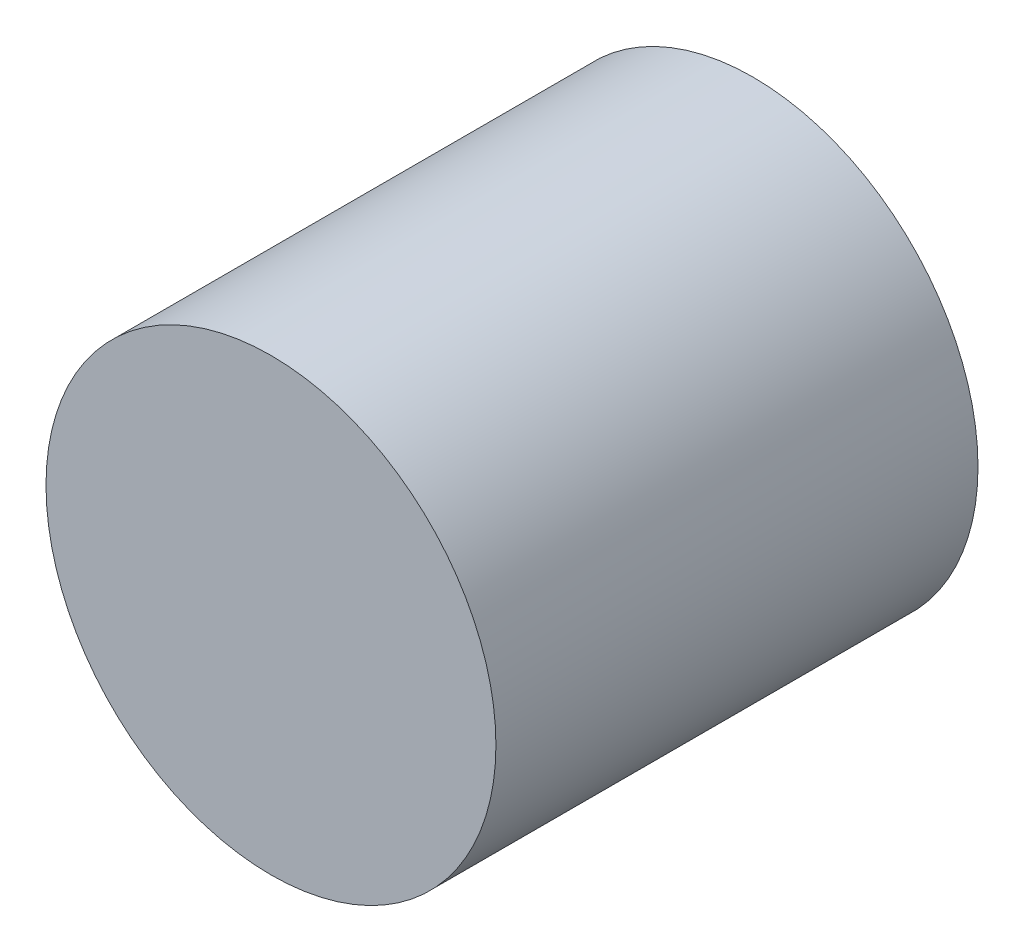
ISO-10303-21;
HEADER;
FILE_DESCRIPTION(('STEP AP214'),'2;1');
FILE_NAME('part.step','',(''),(''),'','','');
FILE_SCHEMA(('AUTOMOTIVE_DESIGN { 1 0 10303 214 1 1 1 1 }'));
ENDSEC;
DATA;
#1=APPLICATION_CONTEXT('core data for automotive mechanical design processes');
#2=APPLICATION_PROTOCOL_DEFINITION('international standard','automotive_design',2000,#1);
#3=PRODUCT_CONTEXT('',#1,'mechanical');
#4=PRODUCT('Part','Part','',(#3));
#5=PRODUCT_RELATED_PRODUCT_CATEGORY('part','',(#4));
#6=PRODUCT_DEFINITION_FORMATION('','',#4);
#7=PRODUCT_DEFINITION_CONTEXT('part definition',#1,'design');
#8=PRODUCT_DEFINITION('design','',#6,#7);
#9=PRODUCT_DEFINITION_SHAPE('','',#8);
#10=(LENGTH_UNIT() NAMED_UNIT(*) SI_UNIT(.MILLI.,.METRE.));
#11=(NAMED_UNIT(*) PLANE_ANGLE_UNIT() SI_UNIT($,.RADIAN.));
#12=(NAMED_UNIT(*) SI_UNIT($,.STERADIAN.) SOLID_ANGLE_UNIT());
#13=UNCERTAINTY_MEASURE_WITH_UNIT(LENGTH_MEASURE(1.E-05),#10,'distance_accuracy_value','');
#14=(GEOMETRIC_REPRESENTATION_CONTEXT(3) GLOBAL_UNCERTAINTY_ASSIGNED_CONTEXT((#13)) GLOBAL_UNIT_ASSIGNED_CONTEXT((#10,
#11,#12)) REPRESENTATION_CONTEXT('',''));
#15=CARTESIAN_POINT('',(0.,0.,0.));
#16=DIRECTION('',(0.,0.,1.));
#17=DIRECTION('',(1.,0.,0.));
#18=AXIS2_PLACEMENT_3D('',#15,#16,#17);
#19=CARTESIAN_POINT('',(0.,0.,150.));
#20=DIRECTION('',(0.,0.,-1.));
#21=DIRECTION('',(-1.,0.,0.));
#22=AXIS2_PLACEMENT_3D('',#19,#20,#21);
#23=CYLINDRICAL_SURFACE('',#22,70.);
#24=CARTESIAN_POINT('',(0.,0.,150.));
#25=DIRECTION('',(0.,0.,1.));
#26=DIRECTION('',(1.,0.,0.));
#27=AXIS2_PLACEMENT_3D('',#24,#25,#26);
#28=CIRCLE('',#27,70.);
#29=CARTESIAN_POINT('',(70.,0.,150.));
#30=VERTEX_POINT('',#29);
#31=EDGE_CURVE('E10',#30,#30,#28,.T.);
#32=ORIENTED_EDGE('',*,*,#31,.F.);
#33=EDGE_LOOP('',(#32));
#34=FACE_BOUND('',#33,.T.);
#35=CARTESIAN_POINT('',(0.,0.,0.));
#36=DIRECTION('',(0.,0.,1.));
#37=DIRECTION('',(1.,0.,0.));
#38=AXIS2_PLACEMENT_3D('',#35,#36,#37);
#39=CIRCLE('',#38,70.);
#40=CARTESIAN_POINT('',(70.,0.,0.));
#41=VERTEX_POINT('',#40);
#42=EDGE_CURVE('E34',#41,#41,#39,.T.);
#43=ORIENTED_EDGE('',*,*,#42,.T.);
#44=EDGE_LOOP('',(#43));
#45=FACE_BOUND('',#44,.T.);
#46=ADVANCED_FACE('F31',(#34,#45),#23,.T.);
#47=CARTESIAN_POINT('',(0.,0.,150.));
#48=DIRECTION('',(0.,0.,1.));
#49=DIRECTION('',(1.,0.,0.));
#50=AXIS2_PLACEMENT_3D('',#47,#48,#49);
#51=PLANE('',#50);
#52=ORIENTED_EDGE('',*,*,#31,.T.);
#53=EDGE_LOOP('',(#52));
#54=FACE_BOUND('',#53,.T.);
#55=ADVANCED_FACE('F46',(#54),#51,.T.);
#56=CARTESIAN_POINT('',(0.,0.,0.));
#57=DIRECTION('',(0.,0.,1.));
#58=DIRECTION('',(1.,0.,0.));
#59=AXIS2_PLACEMENT_3D('',#56,#57,#58);
#60=PLANE('',#59);
#61=ORIENTED_EDGE('',*,*,#42,.F.);
#62=EDGE_LOOP('',(#61));
#63=FACE_BOUND('',#62,.T.);
#64=ADVANCED_FACE('F44',(#63),#60,.F.);
#65=CLOSED_SHELL('',(#46,#55,#64));
#66=MANIFOLD_SOLID_BREP('B2',#65);
#67=ADVANCED_BREP_SHAPE_REPRESENTATION('',(#18,#66),#14);
#68=SHAPE_DEFINITION_REPRESENTATION(#9,#67);
ENDSEC;
END-ISO-10303-21;
